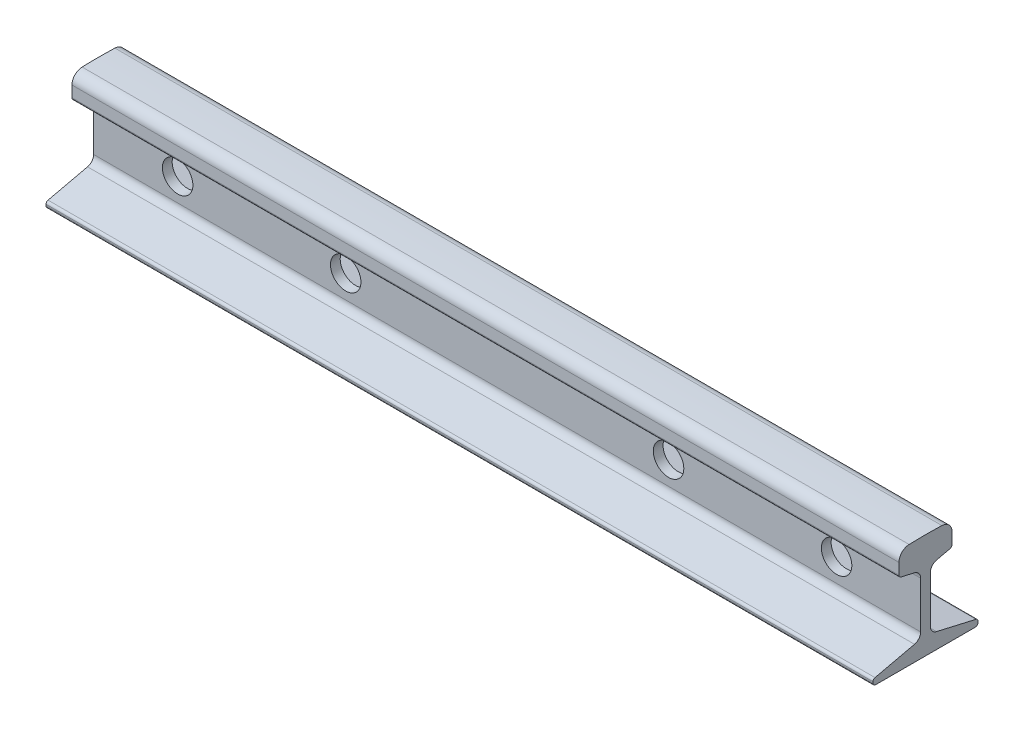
from build123d import *

# Parameters (mm, degrees)
BASE_DEPTH         = 500
FILLET1_R          = 6.35
FILLET2_R          = 4.76
FILLET3_R          = 1.59
SKETCH2_R          = 9.217255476
CUT_EXTRUDE1_DEPTH = 424.659690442


with BuildPart() as part:
    # Sketch1 → Base (new body)
    with BuildSketch(Plane(origin=(0, 0, 0), x_dir=(0, 0, -1), z_dir=(1, 0, 0))):
        with BuildLine():
            Line((16.05, 63.077130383), (16.05, 49.044373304))
            Line((16.05, 49.044373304), (2.95, 46.02))
            Line((2.95, 46.02), (2.95, 10.3))
            Line((2.95, 10.3), (31.75, 3.650996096))
            Line((31.75, 3.650996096), (31.75, 0))
            Line((31.75, 0), (-31.75, 0))
            Line((-31.75, 0), (-31.75, 3.650996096))
            Line((-31.75, 3.650996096), (-2.95, 10.3))
            Line((-2.95, 10.3), (-2.95, 46.02))
            Line((-2.95, 46.02), (-16.05, 49.044373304))
            Line((-16.05, 49.044373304), (-16.05, 63.077130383))
            ThreePointArc((-16.05, 63.077130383), (0, 63.5), (16.05, 63.077130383))
        make_face()
    extrude(amount=BASE_DEPTH)

    # Fillet1
    fillet1_edges = [part.edges().sort_by_distance(p)[0] for p in [
        (250, 63.077130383, -16.05),
        (250, 63.077130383, 16.05),
    ]]
    fillet(fillet1_edges, radius=FILLET1_R)

    # Fillet2
    fillet2_edges = [part.edges().sort_by_distance(p)[0] for p in [
        (250, 46.02, -2.95),
        (250, 10.3, -2.95),
        (250, 10.3, 2.95),
        (250, 46.02, 2.95),
    ]]
    fillet(fillet2_edges, radius=FILLET2_R)

    # Fillet3
    fillet3_edges = [part.edges().sort_by_distance(p)[0] for p in [
        (250, 49.044373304, -16.05),
        (250, 3.650996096, -31.75),
        (250, 0, -31.75),
        (250, 0, 31.75),
        (250, 3.650996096, 31.75),
        (250, 49.044373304, 16.05),
    ]]
    fillet(fillet3_edges, radius=FILLET3_R)

    # Sketch2 → Cut-Extrude1 (cut, through all)
    with BuildSketch(Plane(origin=(416.890903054, -3.473265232, 2.95), x_dir=(1, 0, 0), z_dir=(0, 0, 1))):
        with Locations((-366.094535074, 31.472237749)):
            Circle(SKETCH2_R)
        with Locations((-264.494535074, 31.472237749)):
            Circle(SKETCH2_R)
        with Locations((-69.287271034, 31.472237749)):
            Circle(SKETCH2_R)
        with Locations((32.312728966, 31.472237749)):
            Circle(SKETCH2_R)
    extrude(amount=-CUT_EXTRUDE1_DEPTH, mode=Mode.SUBTRACT)


solid = part.part
